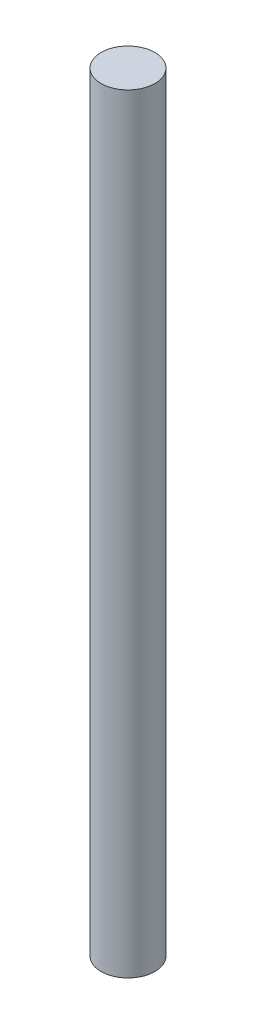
from build123d import *

# Parameters (mm, degrees)
SKETCH1_R           = 4
BOSS_EXTRUDE1_DEPTH = 114.3


with BuildPart() as part:
    # Sketch1 → Boss-Extrude1 (new body)
    with BuildSketch(Plane(origin=(0, 0, 0), x_dir=(1, 0, 0), z_dir=(0, 1, 0))):
        with Locations(Location((0, 0, 0), (0, 0, 270))):
            Circle(SKETCH1_R)
    extrude(amount=BOSS_EXTRUDE1_DEPTH)


solid = part.part
